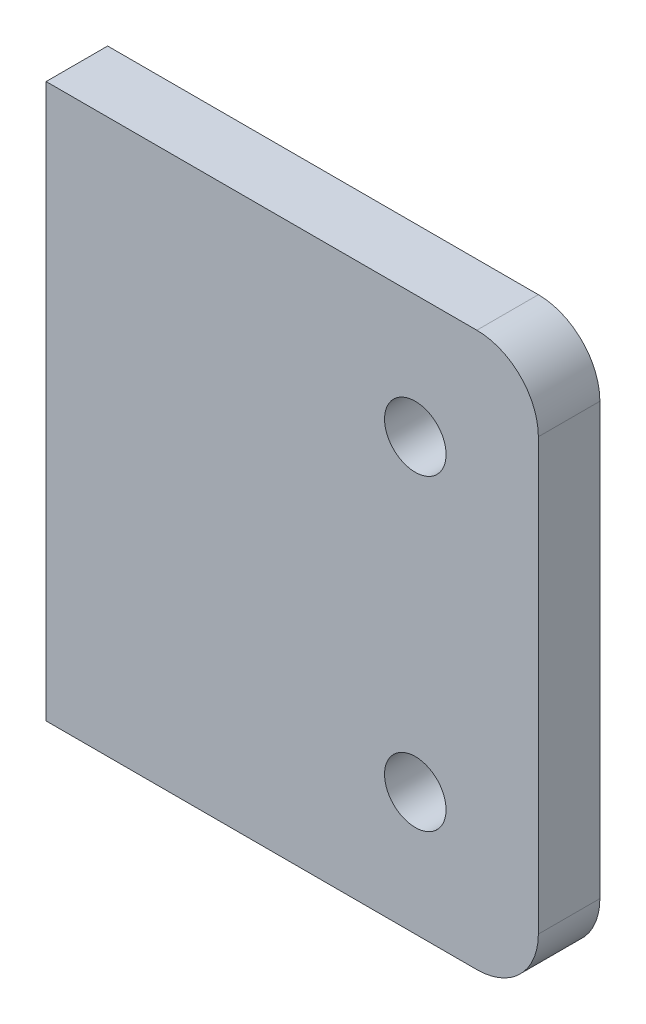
ISO-10303-21;
HEADER;
FILE_DESCRIPTION(('STEP AP214'),'2;1');
FILE_NAME('part.step','',(''),(''),'','','');
FILE_SCHEMA(('AUTOMOTIVE_DESIGN { 1 0 10303 214 1 1 1 1 }'));
ENDSEC;
DATA;
#1=APPLICATION_CONTEXT('core data for automotive mechanical design processes');
#2=APPLICATION_PROTOCOL_DEFINITION('international standard','automotive_design',2000,#1);
#3=PRODUCT_CONTEXT('',#1,'mechanical');
#4=PRODUCT('Part','Part','',(#3));
#5=PRODUCT_RELATED_PRODUCT_CATEGORY('part','',(#4));
#6=PRODUCT_DEFINITION_FORMATION('','',#4);
#7=PRODUCT_DEFINITION_CONTEXT('part definition',#1,'design');
#8=PRODUCT_DEFINITION('design','',#6,#7);
#9=PRODUCT_DEFINITION_SHAPE('','',#8);
#10=(LENGTH_UNIT() NAMED_UNIT(*) SI_UNIT(.MILLI.,.METRE.));
#11=(NAMED_UNIT(*) PLANE_ANGLE_UNIT() SI_UNIT($,.RADIAN.));
#12=(NAMED_UNIT(*) SI_UNIT($,.STERADIAN.) SOLID_ANGLE_UNIT());
#13=UNCERTAINTY_MEASURE_WITH_UNIT(LENGTH_MEASURE(1.E-05),#10,'distance_accuracy_value','');
#14=(GEOMETRIC_REPRESENTATION_CONTEXT(3) GLOBAL_UNCERTAINTY_ASSIGNED_CONTEXT((#13)) GLOBAL_UNIT_ASSIGNED_CONTEXT((#10,
#11,#12)) REPRESENTATION_CONTEXT('',''));
#15=CARTESIAN_POINT('',(0.,0.,0.));
#16=DIRECTION('',(0.,0.,1.));
#17=DIRECTION('',(1.,0.,0.));
#18=AXIS2_PLACEMENT_3D('',#15,#16,#17);
#19=CARTESIAN_POINT('',(44.45,-22.225,6.35));
#20=DIRECTION('',(0.,0.,1.));
#21=DIRECTION('',(1.,0.,0.));
#22=AXIS2_PLACEMENT_3D('',#19,#20,#21);
#23=PLANE('',#22);
#24=CARTESIAN_POINT('',(38.1,15.875,6.35));
#25=DIRECTION('',(0.,0.,1.));
#26=DIRECTION('',(1.,0.,0.));
#27=AXIS2_PLACEMENT_3D('',#24,#25,#26);
#28=CIRCLE('',#27,3.175);
#29=CARTESIAN_POINT('',(41.275,15.875,6.35));
#30=VERTEX_POINT('',#29);
#31=EDGE_CURVE('E100',#30,#30,#28,.T.);
#32=ORIENTED_EDGE('',*,*,#31,.F.);
#33=EDGE_LOOP('',(#32));
#34=FACE_BOUND('',#33,.T.);
#35=DIRECTION('',(0.,-1.,0.));
#36=VECTOR('',#35,1.);
#37=CARTESIAN_POINT('',(0.,28.575,6.35));
#38=LINE('',#37,#36);
#39=CARTESIAN_POINT('',(0.,28.575,6.35));
#40=VERTEX_POINT('',#39);
#41=CARTESIAN_POINT('',(0.,-28.575,6.35));
#42=VERTEX_POINT('',#41);
#43=EDGE_CURVE('E114',#40,#42,#38,.T.);
#44=ORIENTED_EDGE('',*,*,#43,.T.);
#45=DIRECTION('',(1.,0.,0.));
#46=VECTOR('',#45,1.);
#47=CARTESIAN_POINT('',(0.,-28.575,6.35));
#48=LINE('',#47,#46);
#49=CARTESIAN_POINT('',(44.45,-28.575,6.35));
#50=VERTEX_POINT('',#49);
#51=EDGE_CURVE('E95',#42,#50,#48,.T.);
#52=ORIENTED_EDGE('',*,*,#51,.T.);
#53=CARTESIAN_POINT('',(44.45,-22.225,6.35));
#54=DIRECTION('',(0.,0.,1.));
#55=DIRECTION('',(1.,0.,0.));
#56=AXIS2_PLACEMENT_3D('',#53,#54,#55);
#57=CIRCLE('',#56,6.35);
#58=CARTESIAN_POINT('',(50.8,-22.225,6.35));
#59=VERTEX_POINT('',#58);
#60=EDGE_CURVE('E117',#50,#59,#57,.T.);
#61=ORIENTED_EDGE('',*,*,#60,.T.);
#62=DIRECTION('',(0.,1.,0.));
#63=VECTOR('',#62,1.);
#64=CARTESIAN_POINT('',(50.8,22.225,6.35));
#65=LINE('',#64,#63);
#66=CARTESIAN_POINT('',(50.8,22.225,6.35));
#67=VERTEX_POINT('',#66);
#68=EDGE_CURVE('E119',#59,#67,#65,.T.);
#69=ORIENTED_EDGE('',*,*,#68,.T.);
#70=CARTESIAN_POINT('',(44.45,22.225,6.35));
#71=DIRECTION('',(0.,0.,1.));
#72=DIRECTION('',(-1.,0.,0.));
#73=AXIS2_PLACEMENT_3D('',#70,#71,#72);
#74=CIRCLE('',#73,6.35);
#75=CARTESIAN_POINT('',(44.45,28.575,6.35));
#76=VERTEX_POINT('',#75);
#77=EDGE_CURVE('E48',#67,#76,#74,.T.);
#78=ORIENTED_EDGE('',*,*,#77,.T.);
#79=DIRECTION('',(-1.,0.,0.));
#80=VECTOR('',#79,1.);
#81=CARTESIAN_POINT('',(0.,28.575,6.35));
#82=LINE('',#81,#80);
#83=EDGE_CURVE('E43',#76,#40,#82,.T.);
#84=ORIENTED_EDGE('',*,*,#83,.T.);
#85=EDGE_LOOP('',(#44,#52,#61,#69,#78,#84));
#86=FACE_BOUND('',#85,.T.);
#87=CARTESIAN_POINT('',(38.1,-15.875,6.35));
#88=DIRECTION('',(0.,0.,1.));
#89=DIRECTION('',(1.,0.,0.));
#90=AXIS2_PLACEMENT_3D('',#87,#88,#89);
#91=CIRCLE('',#90,3.175);
#92=CARTESIAN_POINT('',(41.275,-15.875,6.35));
#93=VERTEX_POINT('',#92);
#94=EDGE_CURVE('E174',#93,#93,#91,.T.);
#95=ORIENTED_EDGE('',*,*,#94,.F.);
#96=EDGE_LOOP('',(#95));
#97=FACE_BOUND('',#96,.T.);
#98=ADVANCED_FACE('F28',(#34,#86,#97),#23,.T.);
#99=CARTESIAN_POINT('',(44.45,-22.225,0.));
#100=DIRECTION('',(0.,0.,1.));
#101=DIRECTION('',(1.,0.,0.));
#102=AXIS2_PLACEMENT_3D('',#99,#100,#101);
#103=PLANE('',#102);
#104=CARTESIAN_POINT('',(38.1,15.875,0.));
#105=DIRECTION('',(0.,0.,1.));
#106=DIRECTION('',(1.,0.,0.));
#107=AXIS2_PLACEMENT_3D('',#104,#105,#106);
#108=CIRCLE('',#107,3.175);
#109=CARTESIAN_POINT('',(41.275,15.875,0.));
#110=VERTEX_POINT('',#109);
#111=EDGE_CURVE('E103',#110,#110,#108,.T.);
#112=ORIENTED_EDGE('',*,*,#111,.T.);
#113=EDGE_LOOP('',(#112));
#114=FACE_BOUND('',#113,.T.);
#115=DIRECTION('',(0.,-1.,0.));
#116=VECTOR('',#115,1.);
#117=CARTESIAN_POINT('',(0.,28.575,0.));
#118=LINE('',#117,#116);
#119=CARTESIAN_POINT('',(0.,28.575,0.));
#120=VERTEX_POINT('',#119);
#121=CARTESIAN_POINT('',(0.,-28.575,0.));
#122=VERTEX_POINT('',#121);
#123=EDGE_CURVE('E86',#120,#122,#118,.T.);
#124=ORIENTED_EDGE('',*,*,#123,.F.);
#125=DIRECTION('',(-1.,0.,0.));
#126=VECTOR('',#125,1.);
#127=CARTESIAN_POINT('',(0.,28.575,0.));
#128=LINE('',#127,#126);
#129=CARTESIAN_POINT('',(44.45,28.575,0.));
#130=VERTEX_POINT('',#129);
#131=EDGE_CURVE('E112',#130,#120,#128,.T.);
#132=ORIENTED_EDGE('',*,*,#131,.F.);
#133=CARTESIAN_POINT('',(44.45,22.225,0.));
#134=DIRECTION('',(0.,0.,1.));
#135=DIRECTION('',(-1.,0.,0.));
#136=AXIS2_PLACEMENT_3D('',#133,#134,#135);
#137=CIRCLE('',#136,6.35);
#138=CARTESIAN_POINT('',(50.8,22.225,0.));
#139=VERTEX_POINT('',#138);
#140=EDGE_CURVE('E110',#139,#130,#137,.T.);
#141=ORIENTED_EDGE('',*,*,#140,.F.);
#142=DIRECTION('',(0.,1.,0.));
#143=VECTOR('',#142,1.);
#144=CARTESIAN_POINT('',(50.8,22.225,0.));
#145=LINE('',#144,#143);
#146=CARTESIAN_POINT('',(50.8,-22.225,0.));
#147=VERTEX_POINT('',#146);
#148=EDGE_CURVE('E108',#147,#139,#145,.T.);
#149=ORIENTED_EDGE('',*,*,#148,.F.);
#150=CARTESIAN_POINT('',(44.45,-22.225,0.));
#151=DIRECTION('',(0.,0.,1.));
#152=DIRECTION('',(1.,0.,0.));
#153=AXIS2_PLACEMENT_3D('',#150,#151,#152);
#154=CIRCLE('',#153,6.35);
#155=CARTESIAN_POINT('',(44.45,-28.575,0.));
#156=VERTEX_POINT('',#155);
#157=EDGE_CURVE('E88',#156,#147,#154,.T.);
#158=ORIENTED_EDGE('',*,*,#157,.F.);
#159=DIRECTION('',(1.,0.,0.));
#160=VECTOR('',#159,1.);
#161=CARTESIAN_POINT('',(0.,-28.575,0.));
#162=LINE('',#161,#160);
#163=EDGE_CURVE('E81',#122,#156,#162,.T.);
#164=ORIENTED_EDGE('',*,*,#163,.F.);
#165=EDGE_LOOP('',(#124,#132,#141,#149,#158,#164));
#166=FACE_BOUND('',#165,.T.);
#167=CARTESIAN_POINT('',(38.1,-15.875,0.));
#168=DIRECTION('',(0.,0.,1.));
#169=DIRECTION('',(1.,0.,0.));
#170=AXIS2_PLACEMENT_3D('',#167,#168,#169);
#171=CIRCLE('',#170,3.175);
#172=CARTESIAN_POINT('',(41.275,-15.875,0.));
#173=VERTEX_POINT('',#172);
#174=EDGE_CURVE('E177',#173,#173,#171,.T.);
#175=ORIENTED_EDGE('',*,*,#174,.T.);
#176=EDGE_LOOP('',(#175));
#177=FACE_BOUND('',#176,.T.);
#178=ADVANCED_FACE('F82',(#114,#166,#177),#103,.F.);
#179=CARTESIAN_POINT('',(0.,28.575,6.35));
#180=DIRECTION('',(1.,0.,0.));
#181=DIRECTION('',(0.,0.,-1.));
#182=AXIS2_PLACEMENT_3D('',#179,#180,#181);
#183=PLANE('',#182);
#184=ORIENTED_EDGE('',*,*,#123,.T.);
#185=DIRECTION('',(0.,0.,-1.));
#186=VECTOR('',#185,1.);
#187=CARTESIAN_POINT('',(0.,-28.575,6.35));
#188=LINE('',#187,#186);
#189=EDGE_CURVE('E11',#42,#122,#188,.T.);
#190=ORIENTED_EDGE('',*,*,#189,.F.);
#191=ORIENTED_EDGE('',*,*,#43,.F.);
#192=DIRECTION('',(0.,0.,-1.));
#193=VECTOR('',#192,1.);
#194=CARTESIAN_POINT('',(0.,28.575,6.35));
#195=LINE('',#194,#193);
#196=EDGE_CURVE('E99',#40,#120,#195,.T.);
#197=ORIENTED_EDGE('',*,*,#196,.T.);
#198=EDGE_LOOP('',(#184,#190,#191,#197));
#199=FACE_BOUND('',#198,.T.);
#200=ADVANCED_FACE('F30',(#199),#183,.F.);
#201=CARTESIAN_POINT('',(0.,-28.575,6.35));
#202=DIRECTION('',(0.,1.,0.));
#203=DIRECTION('',(-1.,0.,0.));
#204=AXIS2_PLACEMENT_3D('',#201,#202,#203);
#205=PLANE('',#204);
#206=ORIENTED_EDGE('',*,*,#163,.T.);
#207=DIRECTION('',(0.,0.,-1.));
#208=VECTOR('',#207,1.);
#209=CARTESIAN_POINT('',(44.45,-28.575,6.35));
#210=LINE('',#209,#208);
#211=EDGE_CURVE('E36',#50,#156,#210,.T.);
#212=ORIENTED_EDGE('',*,*,#211,.F.);
#213=ORIENTED_EDGE('',*,*,#51,.F.);
#214=ORIENTED_EDGE('',*,*,#189,.T.);
#215=EDGE_LOOP('',(#206,#212,#213,#214));
#216=FACE_BOUND('',#215,.T.);
#217=ADVANCED_FACE('F94',(#216),#205,.F.);
#218=CARTESIAN_POINT('',(44.45,-22.225,6.35));
#219=DIRECTION('',(0.,0.,-1.));
#220=DIRECTION('',(-1.,0.,0.));
#221=AXIS2_PLACEMENT_3D('',#218,#219,#220);
#222=CYLINDRICAL_SURFACE('',#221,6.35);
#223=ORIENTED_EDGE('',*,*,#157,.T.);
#224=DIRECTION('',(0.,0.,-1.));
#225=VECTOR('',#224,1.);
#226=CARTESIAN_POINT('',(50.8,-22.225,6.35));
#227=LINE('',#226,#225);
#228=EDGE_CURVE('E130',#59,#147,#227,.T.);
#229=ORIENTED_EDGE('',*,*,#228,.F.);
#230=ORIENTED_EDGE('',*,*,#60,.F.);
#231=ORIENTED_EDGE('',*,*,#211,.T.);
#232=EDGE_LOOP('',(#223,#229,#230,#231));
#233=FACE_BOUND('',#232,.T.);
#234=ADVANCED_FACE('F134',(#233),#222,.T.);
#235=CARTESIAN_POINT('',(50.8,22.225,6.35));
#236=DIRECTION('',(-1.,0.,0.));
#237=DIRECTION('',(0.,0.,1.));
#238=AXIS2_PLACEMENT_3D('',#235,#236,#237);
#239=PLANE('',#238);
#240=ORIENTED_EDGE('',*,*,#148,.T.);
#241=DIRECTION('',(0.,0.,-1.));
#242=VECTOR('',#241,1.);
#243=CARTESIAN_POINT('',(50.8,22.225,6.35));
#244=LINE('',#243,#242);
#245=EDGE_CURVE('E127',#67,#139,#244,.T.);
#246=ORIENTED_EDGE('',*,*,#245,.F.);
#247=ORIENTED_EDGE('',*,*,#68,.F.);
#248=ORIENTED_EDGE('',*,*,#228,.T.);
#249=EDGE_LOOP('',(#240,#246,#247,#248));
#250=FACE_BOUND('',#249,.T.);
#251=ADVANCED_FACE('F140',(#250),#239,.F.);
#252=CARTESIAN_POINT('',(44.45,22.225,6.35));
#253=DIRECTION('',(0.,0.,-1.));
#254=DIRECTION('',(-1.,0.,0.));
#255=AXIS2_PLACEMENT_3D('',#252,#253,#254);
#256=CYLINDRICAL_SURFACE('',#255,6.35);
#257=ORIENTED_EDGE('',*,*,#140,.T.);
#258=DIRECTION('',(0.,0.,-1.));
#259=VECTOR('',#258,1.);
#260=CARTESIAN_POINT('',(44.45,28.575,6.35));
#261=LINE('',#260,#259);
#262=EDGE_CURVE('E124',#76,#130,#261,.T.);
#263=ORIENTED_EDGE('',*,*,#262,.F.);
#264=ORIENTED_EDGE('',*,*,#77,.F.);
#265=ORIENTED_EDGE('',*,*,#245,.T.);
#266=EDGE_LOOP('',(#257,#263,#264,#265));
#267=FACE_BOUND('',#266,.T.);
#268=ADVANCED_FACE('F143',(#267),#256,.T.);
#269=CARTESIAN_POINT('',(0.,28.575,6.35));
#270=DIRECTION('',(0.,-1.,0.));
#271=DIRECTION('',(1.,0.,0.));
#272=AXIS2_PLACEMENT_3D('',#269,#270,#271);
#273=PLANE('',#272);
#274=ORIENTED_EDGE('',*,*,#131,.T.);
#275=ORIENTED_EDGE('',*,*,#196,.F.);
#276=ORIENTED_EDGE('',*,*,#83,.F.);
#277=ORIENTED_EDGE('',*,*,#262,.T.);
#278=EDGE_LOOP('',(#274,#275,#276,#277));
#279=FACE_BOUND('',#278,.T.);
#280=ADVANCED_FACE('F145',(#279),#273,.F.);
#281=CARTESIAN_POINT('',(38.1,15.875,6.35));
#282=DIRECTION('',(0.,0.,-1.));
#283=DIRECTION('',(-1.,0.,0.));
#284=AXIS2_PLACEMENT_3D('',#281,#282,#283);
#285=CYLINDRICAL_SURFACE('',#284,3.175);
#286=ORIENTED_EDGE('',*,*,#31,.T.);
#287=EDGE_LOOP('',(#286));
#288=FACE_BOUND('',#287,.T.);
#289=ORIENTED_EDGE('',*,*,#111,.F.);
#290=EDGE_LOOP('',(#289));
#291=FACE_BOUND('',#290,.T.);
#292=ADVANCED_FACE('F147',(#288,#291),#285,.F.);
#293=CARTESIAN_POINT('',(38.1,-15.875,6.35));
#294=DIRECTION('',(0.,0.,-1.));
#295=DIRECTION('',(-1.,0.,0.));
#296=AXIS2_PLACEMENT_3D('',#293,#294,#295);
#297=CYLINDRICAL_SURFACE('',#296,3.175);
#298=ORIENTED_EDGE('',*,*,#94,.T.);
#299=EDGE_LOOP('',(#298));
#300=FACE_BOUND('',#299,.T.);
#301=ORIENTED_EDGE('',*,*,#174,.F.);
#302=EDGE_LOOP('',(#301));
#303=FACE_BOUND('',#302,.T.);
#304=ADVANCED_FACE('F153',(#300,#303),#297,.F.);
#305=CLOSED_SHELL('',(#98,#178,#200,#217,#234,#251,#268,#280,#292,#304));
#306=MANIFOLD_SOLID_BREP('B2',#305);
#307=ADVANCED_BREP_SHAPE_REPRESENTATION('',(#18,#306),#14);
#308=SHAPE_DEFINITION_REPRESENTATION(#9,#307);
ENDSEC;
END-ISO-10303-21;
